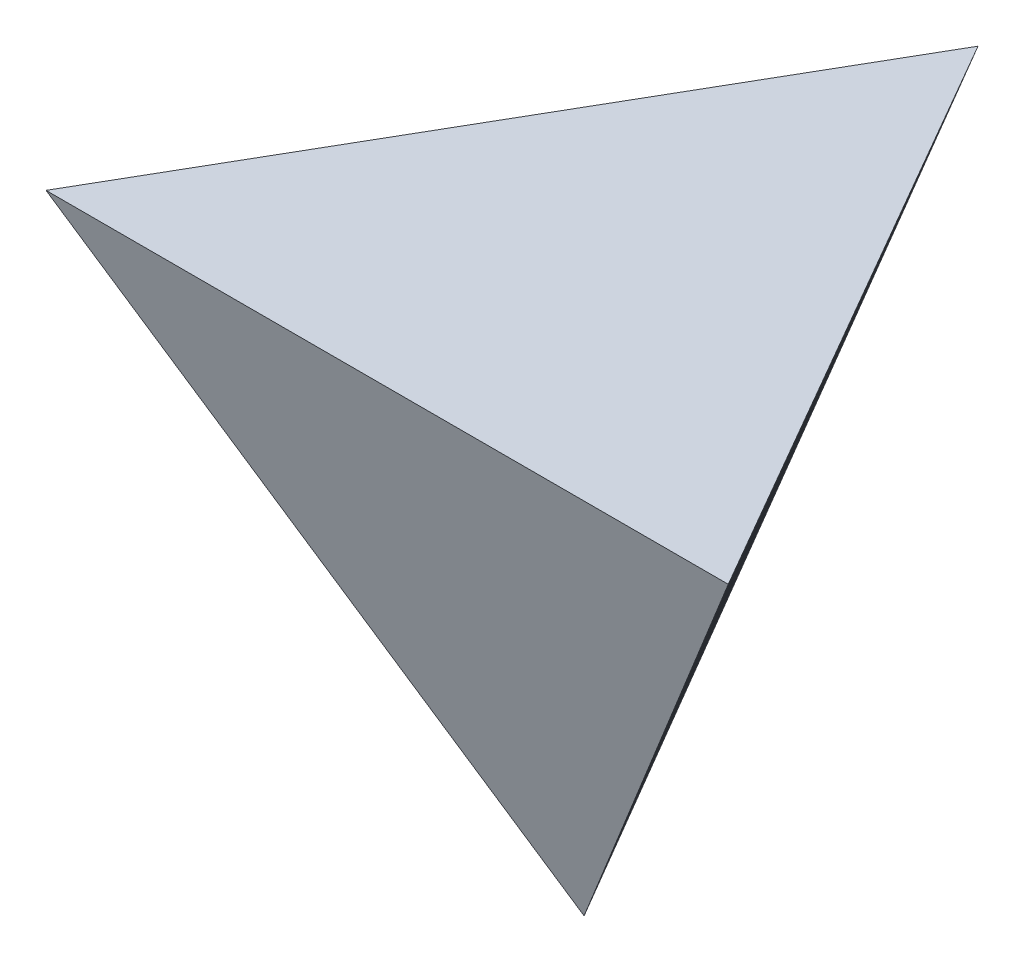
ISO-10303-21;
HEADER;
FILE_DESCRIPTION(('STEP AP214'),'2;1');
FILE_NAME('part.step','',(''),(''),'','','');
FILE_SCHEMA(('AUTOMOTIVE_DESIGN { 1 0 10303 214 1 1 1 1 }'));
ENDSEC;
DATA;
#1=APPLICATION_CONTEXT('core data for automotive mechanical design processes');
#2=APPLICATION_PROTOCOL_DEFINITION('international standard','automotive_design',2000,#1);
#3=PRODUCT_CONTEXT('',#1,'mechanical');
#4=PRODUCT('Part','Part','',(#3));
#5=PRODUCT_RELATED_PRODUCT_CATEGORY('part','',(#4));
#6=PRODUCT_DEFINITION_FORMATION('','',#4);
#7=PRODUCT_DEFINITION_CONTEXT('part definition',#1,'design');
#8=PRODUCT_DEFINITION('design','',#6,#7);
#9=PRODUCT_DEFINITION_SHAPE('','',#8);
#10=(LENGTH_UNIT() NAMED_UNIT(*) SI_UNIT(.MILLI.,.METRE.));
#11=(NAMED_UNIT(*) PLANE_ANGLE_UNIT() SI_UNIT($,.RADIAN.));
#12=(NAMED_UNIT(*) SI_UNIT($,.STERADIAN.) SOLID_ANGLE_UNIT());
#13=UNCERTAINTY_MEASURE_WITH_UNIT(LENGTH_MEASURE(1.E-05),#10,'distance_accuracy_value','');
#14=(GEOMETRIC_REPRESENTATION_CONTEXT(3) GLOBAL_UNCERTAINTY_ASSIGNED_CONTEXT((#13)) GLOBAL_UNIT_ASSIGNED_CONTEXT((#10,
#11,#12)) REPRESENTATION_CONTEXT('',''));
#15=CARTESIAN_POINT('',(0.,0.,0.));
#16=DIRECTION('',(0.,0.,1.));
#17=DIRECTION('',(1.,0.,0.));
#18=AXIS2_PLACEMENT_3D('',#15,#16,#17);
#19=CARTESIAN_POINT('',(0.,50.,0.));
#20=DIRECTION('',(0.,-0.333806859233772,0.942641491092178));
#21=DIRECTION('',(0.,-0.942641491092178,-0.333806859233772));
#22=AXIS2_PLACEMENT_3D('',#19,#20,#21);
#23=PLANE('',#22);
#24=DIRECTION('',(0.500532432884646,-0.816061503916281,-0.288982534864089));
#25=VECTOR('',#24,1.);
#26=CARTESIAN_POINT('',(-18.7366820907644,39.788368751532,-3.61612828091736));
#27=LINE('',#26,#25);
#28=CARTESIAN_POINT('',(-25.,50.,0.));
#29=VERTEX_POINT('',#28);
#30=CARTESIAN_POINT('',(0.,9.24032838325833,-14.4337567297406));
#31=VERTEX_POINT('',#30);
#32=EDGE_CURVE('E66',#29,#31,#27,.T.);
#33=ORIENTED_EDGE('',*,*,#32,.T.);
#34=DIRECTION('',(-0.500532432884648,-0.81606150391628,-0.288982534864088));
#35=VECTOR('',#34,1.);
#36=CARTESIAN_POINT('',(25.,50.,0.));
#37=LINE('',#36,#35);
#38=CARTESIAN_POINT('',(25.,50.,0.));
#39=VERTEX_POINT('',#38);
#40=EDGE_CURVE('E11',#39,#31,#37,.T.);
#41=ORIENTED_EDGE('',*,*,#40,.F.);
#42=DIRECTION('',(1.,0.,0.));
#43=VECTOR('',#42,1.);
#44=CARTESIAN_POINT('',(0.,50.,0.));
#45=LINE('',#44,#43);
#46=EDGE_CURVE('E54',#29,#39,#45,.T.);
#47=ORIENTED_EDGE('',*,*,#46,.F.);
#48=EDGE_LOOP('',(#33,#41,#47));
#49=FACE_BOUND('',#48,.T.);
#50=ADVANCED_FACE('F33',(#49),#23,.T.);
#51=CARTESIAN_POINT('',(25.,50.,0.));
#52=DIRECTION('',(0.816351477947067,-0.333806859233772,-0.471320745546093));
#53=DIRECTION('',(-0.500000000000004,0.,-0.866025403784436));
#54=AXIS2_PLACEMENT_3D('',#51,#52,#53);
#55=PLANE('',#54);
#56=ORIENTED_EDGE('',*,*,#40,.T.);
#57=DIRECTION('',(0.,-0.816061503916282,0.577965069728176));
#58=VECTOR('',#57,1.);
#59=CARTESIAN_POINT('',(-1.04083408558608E-13,29.5767375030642,-28.8367570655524));
#60=LINE('',#59,#58);
#61=CARTESIAN_POINT('',(-1.47451495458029E-13,50.,-43.3012701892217));
#62=VERTEX_POINT('',#61);
#63=EDGE_CURVE('E41',#62,#31,#60,.T.);
#64=ORIENTED_EDGE('',*,*,#63,.F.);
#65=DIRECTION('',(-0.500000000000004,0.,-0.866025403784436));
#66=VECTOR('',#65,1.);
#67=CARTESIAN_POINT('',(25.,50.,0.));
#68=LINE('',#67,#66);
#69=EDGE_CURVE('E61',#39,#62,#68,.T.);
#70=ORIENTED_EDGE('',*,*,#69,.F.);
#71=EDGE_LOOP('',(#56,#64,#70));
#72=FACE_BOUND('',#71,.T.);
#73=ADVANCED_FACE('F60',(#72),#55,.T.);
#74=CARTESIAN_POINT('',(-25.,50.,0.));
#75=DIRECTION('',(-0.816351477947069,-0.333806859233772,-0.471320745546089));
#76=DIRECTION('',(-0.5,0.,0.866025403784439));
#77=AXIS2_PLACEMENT_3D('',#74,#75,#76);
#78=PLANE('',#77);
#79=ORIENTED_EDGE('',*,*,#63,.T.);
#80=ORIENTED_EDGE('',*,*,#32,.F.);
#81=DIRECTION('',(-0.5,0.,0.866025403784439));
#82=VECTOR('',#81,1.);
#83=CARTESIAN_POINT('',(-25.,50.,0.));
#84=LINE('',#83,#82);
#85=EDGE_CURVE('E48',#62,#29,#84,.T.);
#86=ORIENTED_EDGE('',*,*,#85,.F.);
#87=EDGE_LOOP('',(#79,#80,#86));
#88=FACE_BOUND('',#87,.T.);
#89=ADVANCED_FACE('F65',(#88),#78,.T.);
#90=CARTESIAN_POINT('',(0.,50.,0.));
#91=DIRECTION('',(0.,-1.,0.));
#92=DIRECTION('',(0.,0.,-1.));
#93=AXIS2_PLACEMENT_3D('',#90,#91,#92);
#94=PLANE('',#93);
#95=ORIENTED_EDGE('',*,*,#46,.T.);
#96=ORIENTED_EDGE('',*,*,#69,.T.);
#97=ORIENTED_EDGE('',*,*,#85,.T.);
#98=EDGE_LOOP('',(#95,#96,#97));
#99=FACE_BOUND('',#98,.T.);
#100=ADVANCED_FACE('F71',(#99),#94,.F.);
#101=CLOSED_SHELL('',(#50,#73,#89,#100));
#102=MANIFOLD_SOLID_BREP('B2',#101);
#103=ADVANCED_BREP_SHAPE_REPRESENTATION('',(#18,#102),#14);
#104=SHAPE_DEFINITION_REPRESENTATION(#9,#103);
ENDSEC;
END-ISO-10303-21;
